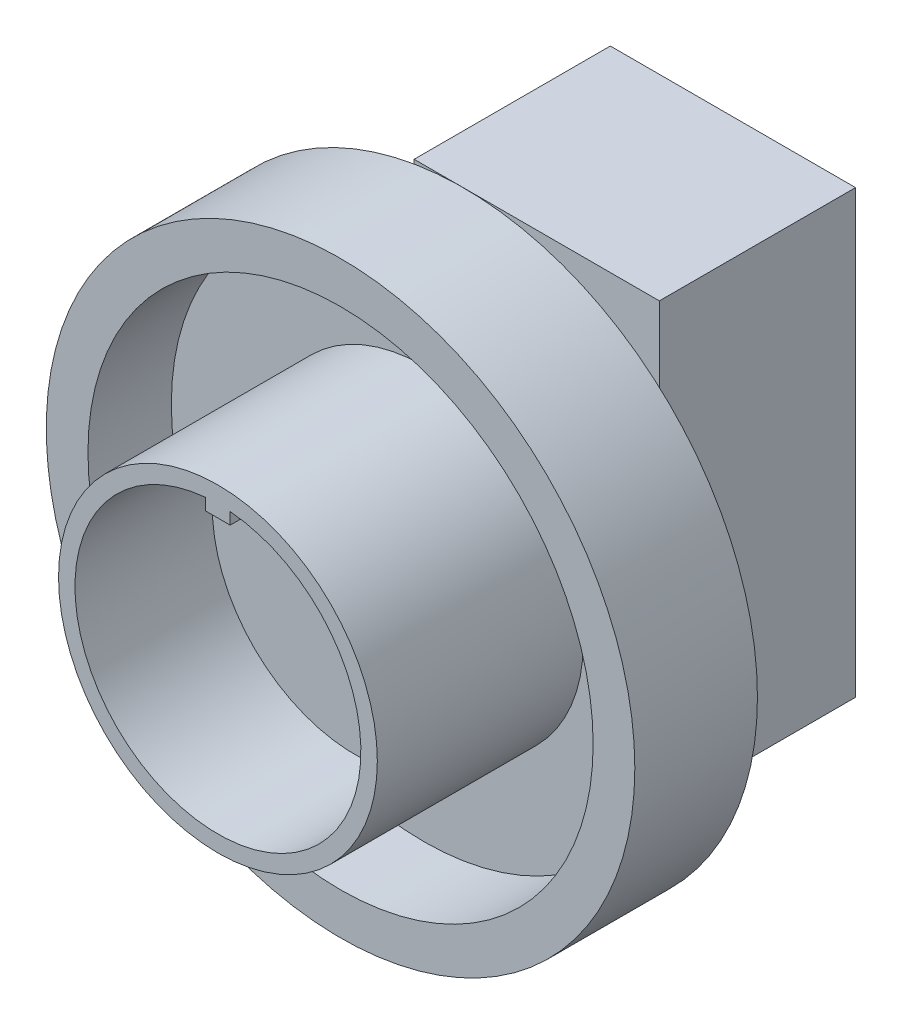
ISO-10303-21;
HEADER;
FILE_DESCRIPTION(('STEP AP214'),'2;1');
FILE_NAME('part.step','',(''),(''),'','','');
FILE_SCHEMA(('AUTOMOTIVE_DESIGN { 1 0 10303 214 1 1 1 1 }'));
ENDSEC;
DATA;
#1=APPLICATION_CONTEXT('core data for automotive mechanical design processes');
#2=APPLICATION_PROTOCOL_DEFINITION('international standard','automotive_design',2000,#1);
#3=PRODUCT_CONTEXT('',#1,'mechanical');
#4=PRODUCT('Part','Part','',(#3));
#5=PRODUCT_RELATED_PRODUCT_CATEGORY('part','',(#4));
#6=PRODUCT_DEFINITION_FORMATION('','',#4);
#7=PRODUCT_DEFINITION_CONTEXT('part definition',#1,'design');
#8=PRODUCT_DEFINITION('design','',#6,#7);
#9=PRODUCT_DEFINITION_SHAPE('','',#8);
#10=(LENGTH_UNIT() NAMED_UNIT(*) SI_UNIT(.MILLI.,.METRE.));
#11=(NAMED_UNIT(*) PLANE_ANGLE_UNIT() SI_UNIT($,.RADIAN.));
#12=(NAMED_UNIT(*) SI_UNIT($,.STERADIAN.) SOLID_ANGLE_UNIT());
#13=UNCERTAINTY_MEASURE_WITH_UNIT(LENGTH_MEASURE(1.E-05),#10,'distance_accuracy_value','');
#14=(GEOMETRIC_REPRESENTATION_CONTEXT(3) GLOBAL_UNCERTAINTY_ASSIGNED_CONTEXT((#13)) GLOBAL_UNIT_ASSIGNED_CONTEXT((#10,
#11,#12)) REPRESENTATION_CONTEXT('',''));
#15=CARTESIAN_POINT('',(0.,0.,0.));
#16=DIRECTION('',(0.,0.,1.));
#17=DIRECTION('',(1.,0.,0.));
#18=AXIS2_PLACEMENT_3D('',#15,#16,#17);
#19=CARTESIAN_POINT('',(0.,0.,0.));
#20=DIRECTION('',(0.,0.,1.));
#21=DIRECTION('',(1.,0.,0.));
#22=AXIS2_PLACEMENT_3D('',#19,#20,#21);
#23=CYLINDRICAL_SURFACE('',#22,25.);
#24=CARTESIAN_POINT('',(0.,0.,-50.));
#25=DIRECTION('',(0.,0.,1.));
#26=DIRECTION('',(1.,0.,0.));
#27=AXIS2_PLACEMENT_3D('',#24,#25,#26);
#28=CIRCLE('',#27,25.);
#29=CARTESIAN_POINT('',(25.,0.,-50.));
#30=VERTEX_POINT('',#29);
#31=EDGE_CURVE('E298',#30,#30,#28,.T.);
#32=ORIENTED_EDGE('',*,*,#31,.F.);
#33=EDGE_LOOP('',(#32));
#34=FACE_BOUND('',#33,.T.);
#35=CARTESIAN_POINT('',(0.,0.,-65.));
#36=DIRECTION('',(0.,0.,1.));
#37=DIRECTION('',(1.,0.,0.));
#38=AXIS2_PLACEMENT_3D('',#35,#36,#37);
#39=CIRCLE('',#38,25.);
#40=CARTESIAN_POINT('',(25.,0.,-65.));
#41=VERTEX_POINT('',#40);
#42=CARTESIAN_POINT('',(-25.,0.,-65.));
#43=VERTEX_POINT('',#42);
#44=EDGE_CURVE('E41',#41,#43,#39,.T.);
#45=ORIENTED_EDGE('',*,*,#44,.T.);
#46=EDGE_CURVE('E300',#43,#41,#39,.T.);
#47=ORIENTED_EDGE('',*,*,#46,.T.);
#48=EDGE_LOOP('',(#45,#47));
#49=FACE_BOUND('',#48,.T.);
#50=ADVANCED_FACE('F34',(#34,#49),#23,.T.);
#51=CARTESIAN_POINT('',(0.,25.,-50.));
#52=DIRECTION('',(0.,0.,1.));
#53=DIRECTION('',(1.,0.,0.));
#54=AXIS2_PLACEMENT_3D('',#51,#52,#53);
#55=PLANE('',#54);
#56=CARTESIAN_POINT('',(0.,0.,-50.));
#57=DIRECTION('',(0.,0.,1.));
#58=DIRECTION('',(1.,0.,0.));
#59=AXIS2_PLACEMENT_3D('',#56,#57,#58);
#60=CIRCLE('',#59,60.);
#61=CARTESIAN_POINT('',(60.,0.,-50.));
#62=VERTEX_POINT('',#61);
#63=EDGE_CURVE('E295',#62,#62,#60,.T.);
#64=ORIENTED_EDGE('',*,*,#63,.F.);
#65=EDGE_LOOP('',(#64));
#66=FACE_BOUND('',#65,.T.);
#67=ORIENTED_EDGE('',*,*,#31,.T.);
#68=EDGE_LOOP('',(#67));
#69=FACE_BOUND('',#68,.T.);
#70=ADVANCED_FACE('F344',(#66,#69),#55,.F.);
#71=CARTESIAN_POINT('',(0.,0.,0.));
#72=DIRECTION('',(0.,0.,1.));
#73=DIRECTION('',(1.,0.,0.));
#74=AXIS2_PLACEMENT_3D('',#71,#72,#73);
#75=CYLINDRICAL_SURFACE('',#74,60.);
#76=CARTESIAN_POINT('',(0.,0.,-25.));
#77=DIRECTION('',(0.,0.,1.));
#78=DIRECTION('',(1.,0.,0.));
#79=AXIS2_PLACEMENT_3D('',#76,#77,#78);
#80=CIRCLE('',#79,60.);
#81=CARTESIAN_POINT('',(60.,0.,-25.));
#82=VERTEX_POINT('',#81);
#83=EDGE_CURVE('E292',#82,#82,#80,.T.);
#84=ORIENTED_EDGE('',*,*,#83,.F.);
#85=EDGE_LOOP('',(#84));
#86=FACE_BOUND('',#85,.T.);
#87=ORIENTED_EDGE('',*,*,#63,.T.);
#88=EDGE_LOOP('',(#87));
#89=FACE_BOUND('',#88,.T.);
#90=ADVANCED_FACE('F349',(#86,#89),#75,.T.);
#91=CARTESIAN_POINT('',(0.,60.,-25.));
#92=DIRECTION('',(0.,0.,-1.));
#93=DIRECTION('',(-1.,0.,0.));
#94=AXIS2_PLACEMENT_3D('',#91,#92,#93);
#95=PLANE('',#94);
#96=CARTESIAN_POINT('',(0.,0.,-25.));
#97=DIRECTION('',(0.,0.,1.));
#98=DIRECTION('',(1.,0.,0.));
#99=AXIS2_PLACEMENT_3D('',#96,#97,#98);
#100=CIRCLE('',#99,51.5);
#101=CARTESIAN_POINT('',(51.5,0.,-25.));
#102=VERTEX_POINT('',#101);
#103=EDGE_CURVE('E289',#102,#102,#100,.T.);
#104=ORIENTED_EDGE('',*,*,#103,.F.);
#105=EDGE_LOOP('',(#104));
#106=FACE_BOUND('',#105,.T.);
#107=ORIENTED_EDGE('',*,*,#83,.T.);
#108=EDGE_LOOP('',(#107));
#109=FACE_BOUND('',#108,.T.);
#110=ADVANCED_FACE('F356',(#106,#109),#95,.F.);
#111=CARTESIAN_POINT('',(0.,0.,0.));
#112=DIRECTION('',(0.,0.,1.));
#113=DIRECTION('',(1.,0.,0.));
#114=AXIS2_PLACEMENT_3D('',#111,#112,#113);
#115=CYLINDRICAL_SURFACE('',#114,51.5);
#116=CARTESIAN_POINT('',(0.,0.,-42.));
#117=DIRECTION('',(0.,0.,1.));
#118=DIRECTION('',(1.,0.,0.));
#119=AXIS2_PLACEMENT_3D('',#116,#117,#118);
#120=CIRCLE('',#119,51.5);
#121=CARTESIAN_POINT('',(51.5,0.,-42.));
#122=VERTEX_POINT('',#121);
#123=EDGE_CURVE('E286',#122,#122,#120,.T.);
#124=ORIENTED_EDGE('',*,*,#123,.F.);
#125=EDGE_LOOP('',(#124));
#126=FACE_BOUND('',#125,.T.);
#127=ORIENTED_EDGE('',*,*,#103,.T.);
#128=EDGE_LOOP('',(#127));
#129=FACE_BOUND('',#128,.T.);
#130=ADVANCED_FACE('F363',(#126,#129),#115,.F.);
#131=CARTESIAN_POINT('',(0.,51.5,-42.));
#132=DIRECTION('',(0.,0.,-1.));
#133=DIRECTION('',(-1.,0.,0.));
#134=AXIS2_PLACEMENT_3D('',#131,#132,#133);
#135=PLANE('',#134);
#136=CARTESIAN_POINT('',(0.,0.,-42.));
#137=DIRECTION('',(0.,0.,1.));
#138=DIRECTION('',(1.,0.,0.));
#139=AXIS2_PLACEMENT_3D('',#136,#137,#138);
#140=CIRCLE('',#139,32.5);
#141=CARTESIAN_POINT('',(32.5,0.,-42.));
#142=VERTEX_POINT('',#141);
#143=EDGE_CURVE('E283',#142,#142,#140,.T.);
#144=ORIENTED_EDGE('',*,*,#143,.F.);
#145=EDGE_LOOP('',(#144));
#146=FACE_BOUND('',#145,.T.);
#147=ORIENTED_EDGE('',*,*,#123,.T.);
#148=EDGE_LOOP('',(#147));
#149=FACE_BOUND('',#148,.T.);
#150=ADVANCED_FACE('F367',(#146,#149),#135,.F.);
#151=CARTESIAN_POINT('',(0.,0.,0.));
#152=DIRECTION('',(0.,0.,1.));
#153=DIRECTION('',(1.,0.,0.));
#154=AXIS2_PLACEMENT_3D('',#151,#152,#153);
#155=CYLINDRICAL_SURFACE('',#154,32.5);
#156=CARTESIAN_POINT('',(0.,0.,0.));
#157=DIRECTION('',(0.,0.,1.));
#158=DIRECTION('',(1.,0.,0.));
#159=AXIS2_PLACEMENT_3D('',#156,#157,#158);
#160=CIRCLE('',#159,32.5);
#161=CARTESIAN_POINT('',(32.5,0.,0.));
#162=VERTEX_POINT('',#161);
#163=EDGE_CURVE('E280',#162,#162,#160,.T.);
#164=ORIENTED_EDGE('',*,*,#163,.F.);
#165=EDGE_LOOP('',(#164));
#166=FACE_BOUND('',#165,.T.);
#167=ORIENTED_EDGE('',*,*,#143,.T.);
#168=EDGE_LOOP('',(#167));
#169=FACE_BOUND('',#168,.T.);
#170=ADVANCED_FACE('F371',(#166,#169),#155,.T.);
#171=CARTESIAN_POINT('',(0.,32.5,0.));
#172=DIRECTION('',(0.,0.,-1.));
#173=DIRECTION('',(-1.,0.,0.));
#174=AXIS2_PLACEMENT_3D('',#171,#172,#173);
#175=PLANE('',#174);
#176=CARTESIAN_POINT('',(0.,0.,0.));
#177=DIRECTION('',(0.,0.,1.));
#178=DIRECTION('',(1.,0.,0.));
#179=AXIS2_PLACEMENT_3D('',#176,#177,#178);
#180=CIRCLE('',#179,29.15);
#181=CARTESIAN_POINT('',(-2.5,29.0425980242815,0.));
#182=VERTEX_POINT('',#181);
#183=CARTESIAN_POINT('',(2.5,29.0425980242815,0.));
#184=VERTEX_POINT('',#183);
#185=EDGE_CURVE('E277',#182,#184,#180,.T.);
#186=ORIENTED_EDGE('',*,*,#185,.F.);
#187=DIRECTION('',(0.,-1.,0.));
#188=VECTOR('',#187,1.);
#189=CARTESIAN_POINT('',(-2.5,31.65,0.));
#190=LINE('',#189,#188);
#191=CARTESIAN_POINT('',(-2.5,26.65,0.));
#192=VERTEX_POINT('',#191);
#193=EDGE_CURVE('E256',#182,#192,#190,.T.);
#194=ORIENTED_EDGE('',*,*,#193,.T.);
#195=DIRECTION('',(1.,0.,0.));
#196=VECTOR('',#195,1.);
#197=CARTESIAN_POINT('',(-2.5,26.65,0.));
#198=LINE('',#197,#196);
#199=CARTESIAN_POINT('',(2.5,26.65,0.));
#200=VERTEX_POINT('',#199);
#201=EDGE_CURVE('E252',#192,#200,#198,.T.);
#202=ORIENTED_EDGE('',*,*,#201,.T.);
#203=DIRECTION('',(0.,1.,0.));
#204=VECTOR('',#203,1.);
#205=CARTESIAN_POINT('',(2.5,31.65,0.));
#206=LINE('',#205,#204);
#207=EDGE_CURVE('E251',#200,#184,#206,.T.);
#208=ORIENTED_EDGE('',*,*,#207,.T.);
#209=EDGE_LOOP('',(#186,#194,#202,#208));
#210=FACE_BOUND('',#209,.T.);
#211=ORIENTED_EDGE('',*,*,#163,.T.);
#212=EDGE_LOOP('',(#211));
#213=FACE_BOUND('',#212,.T.);
#214=ADVANCED_FACE('F375',(#210,#213),#175,.F.);
#215=CARTESIAN_POINT('',(0.,0.,0.));
#216=DIRECTION('',(0.,0.,1.));
#217=DIRECTION('',(1.,0.,0.));
#218=AXIS2_PLACEMENT_3D('',#215,#216,#217);
#219=CYLINDRICAL_SURFACE('',#218,29.15);
#220=CARTESIAN_POINT('',(0.,0.,-28.));
#221=DIRECTION('',(0.,0.,1.));
#222=DIRECTION('',(1.,0.,0.));
#223=AXIS2_PLACEMENT_3D('',#220,#221,#222);
#224=CIRCLE('',#223,29.15);
#225=CARTESIAN_POINT('',(-2.5,29.0425980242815,-28.));
#226=VERTEX_POINT('',#225);
#227=CARTESIAN_POINT('',(2.5,29.0425980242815,-28.));
#228=VERTEX_POINT('',#227);
#229=EDGE_CURVE('E274',#226,#228,#224,.T.);
#230=ORIENTED_EDGE('',*,*,#229,.F.);
#231=DIRECTION('',(0.,0.,1.));
#232=VECTOR('',#231,1.);
#233=CARTESIAN_POINT('',(-2.5,29.0425980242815,0.));
#234=LINE('',#233,#232);
#235=EDGE_CURVE('E271',#226,#182,#234,.T.);
#236=ORIENTED_EDGE('',*,*,#235,.T.);
#237=ORIENTED_EDGE('',*,*,#185,.T.);
#238=DIRECTION('',(0.,0.,1.));
#239=VECTOR('',#238,1.);
#240=CARTESIAN_POINT('',(2.5,29.0425980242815,0.));
#241=LINE('',#240,#239);
#242=EDGE_CURVE('E262',#184,#228,#241,.F.);
#243=ORIENTED_EDGE('',*,*,#242,.T.);
#244=EDGE_LOOP('',(#230,#236,#237,#243));
#245=FACE_BOUND('',#244,.T.);
#246=ADVANCED_FACE('F379',(#245),#219,.F.);
#247=CARTESIAN_POINT('',(0.,29.15,-28.));
#248=DIRECTION('',(0.,0.,-1.));
#249=DIRECTION('',(-1.,0.,0.));
#250=AXIS2_PLACEMENT_3D('',#247,#248,#249);
#251=PLANE('',#250);
#252=DIRECTION('',(1.,0.,0.));
#253=VECTOR('',#252,1.);
#254=CARTESIAN_POINT('',(-2.5,26.65,-28.));
#255=LINE('',#254,#253);
#256=CARTESIAN_POINT('',(-2.5,26.65,-28.));
#257=VERTEX_POINT('',#256);
#258=CARTESIAN_POINT('',(2.5,26.65,-28.));
#259=VERTEX_POINT('',#258);
#260=EDGE_CURVE('E264',#257,#259,#255,.T.);
#261=ORIENTED_EDGE('',*,*,#260,.F.);
#262=DIRECTION('',(0.,1.,0.));
#263=VECTOR('',#262,1.);
#264=CARTESIAN_POINT('',(-2.5,29.15,-28.));
#265=LINE('',#264,#263);
#266=EDGE_CURVE('E12',#257,#226,#265,.T.);
#267=ORIENTED_EDGE('',*,*,#266,.T.);
#268=ORIENTED_EDGE('',*,*,#229,.T.);
#269=DIRECTION('',(0.,1.,0.));
#270=VECTOR('',#269,1.);
#271=CARTESIAN_POINT('',(2.5,31.65,-28.));
#272=LINE('',#271,#270);
#273=EDGE_CURVE('E260',#259,#228,#272,.T.);
#274=ORIENTED_EDGE('',*,*,#273,.F.);
#275=EDGE_LOOP('',(#261,#267,#268,#274));
#276=FACE_BOUND('',#275,.T.);
#277=ADVANCED_FACE('F383',(#276),#251,.F.);
#278=CARTESIAN_POINT('',(-2.5,31.65,-35.0710678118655));
#279=DIRECTION('',(-1.,0.,0.));
#280=DIRECTION('',(0.,-1.,0.));
#281=AXIS2_PLACEMENT_3D('',#278,#279,#280);
#282=PLANE('',#281);
#283=ORIENTED_EDGE('',*,*,#235,.F.);
#284=ORIENTED_EDGE('',*,*,#266,.F.);
#285=DIRECTION('',(0.,0.,1.));
#286=VECTOR('',#285,1.);
#287=CARTESIAN_POINT('',(-2.5,26.65,-35.0710678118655));
#288=LINE('',#287,#286);
#289=EDGE_CURVE('E255',#257,#192,#288,.T.);
#290=ORIENTED_EDGE('',*,*,#289,.T.);
#291=ORIENTED_EDGE('',*,*,#193,.F.);
#292=EDGE_LOOP('',(#283,#284,#290,#291));
#293=FACE_BOUND('',#292,.T.);
#294=ADVANCED_FACE('F387',(#293),#282,.T.);
#295=CARTESIAN_POINT('',(2.5,31.65,-35.0710678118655));
#296=DIRECTION('',(1.,0.,0.));
#297=DIRECTION('',(0.,1.,0.));
#298=AXIS2_PLACEMENT_3D('',#295,#296,#297);
#299=PLANE('',#298);
#300=ORIENTED_EDGE('',*,*,#242,.F.);
#301=ORIENTED_EDGE('',*,*,#207,.F.);
#302=DIRECTION('',(0.,0.,1.));
#303=VECTOR('',#302,1.);
#304=CARTESIAN_POINT('',(2.5,26.65,-35.0710678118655));
#305=LINE('',#304,#303);
#306=EDGE_CURVE('E263',#259,#200,#305,.T.);
#307=ORIENTED_EDGE('',*,*,#306,.F.);
#308=ORIENTED_EDGE('',*,*,#273,.T.);
#309=EDGE_LOOP('',(#300,#301,#307,#308));
#310=FACE_BOUND('',#309,.T.);
#311=ADVANCED_FACE('F391',(#310),#299,.T.);
#312=CARTESIAN_POINT('',(-2.5,26.65,-35.0710678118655));
#313=DIRECTION('',(0.,-1.,0.));
#314=DIRECTION('',(0.,0.,-1.));
#315=AXIS2_PLACEMENT_3D('',#312,#313,#314);
#316=PLANE('',#315);
#317=ORIENTED_EDGE('',*,*,#289,.F.);
#318=ORIENTED_EDGE('',*,*,#260,.T.);
#319=ORIENTED_EDGE('',*,*,#306,.T.);
#320=ORIENTED_EDGE('',*,*,#201,.F.);
#321=EDGE_LOOP('',(#317,#318,#319,#320));
#322=FACE_BOUND('',#321,.T.);
#323=ADVANCED_FACE('F393',(#322),#316,.T.);
#324=CARTESIAN_POINT('',(0.,0.,-65.));
#325=DIRECTION('',(0.,0.,-1.));
#326=DIRECTION('',(-1.,0.,0.));
#327=AXIS2_PLACEMENT_3D('',#324,#325,#326);
#328=PLANE('',#327);
#329=ORIENTED_EDGE('',*,*,#44,.F.);
#330=DIRECTION('',(0.,-1.,0.));
#331=VECTOR('',#330,1.);
#332=CARTESIAN_POINT('',(25.,45.,-65.));
#333=LINE('',#332,#331);
#334=CARTESIAN_POINT('',(25.,45.,-65.));
#335=VERTEX_POINT('',#334);
#336=EDGE_CURVE('E237',#335,#41,#333,.T.);
#337=ORIENTED_EDGE('',*,*,#336,.F.);
#338=DIRECTION('',(1.,0.,0.));
#339=VECTOR('',#338,1.);
#340=CARTESIAN_POINT('',(25.,45.,-65.));
#341=LINE('',#340,#339);
#342=CARTESIAN_POINT('',(-25.,45.,-65.));
#343=VERTEX_POINT('',#342);
#344=EDGE_CURVE('E234',#343,#335,#341,.T.);
#345=ORIENTED_EDGE('',*,*,#344,.F.);
#346=DIRECTION('',(0.,1.,0.));
#347=VECTOR('',#346,1.);
#348=CARTESIAN_POINT('',(-25.,45.,-65.));
#349=LINE('',#348,#347);
#350=EDGE_CURVE('E219',#43,#343,#349,.T.);
#351=ORIENTED_EDGE('',*,*,#350,.F.);
#352=EDGE_LOOP('',(#329,#337,#345,#351));
#353=FACE_BOUND('',#352,.T.);
#354=ADVANCED_FACE('F313',(#353),#328,.F.);
#355=CARTESIAN_POINT('',(-25.,45.,-105.));
#356=DIRECTION('',(1.,0.,0.));
#357=DIRECTION('',(0.,1.,0.));
#358=AXIS2_PLACEMENT_3D('',#355,#356,#357);
#359=PLANE('',#358);
#360=CARTESIAN_POINT('',(-25.,-45.,-65.));
#361=VERTEX_POINT('',#360);
#362=EDGE_CURVE('E231',#361,#43,#349,.T.);
#363=ORIENTED_EDGE('',*,*,#362,.T.);
#364=ORIENTED_EDGE('',*,*,#350,.T.);
#365=DIRECTION('',(0.,0.,1.));
#366=VECTOR('',#365,1.);
#367=CARTESIAN_POINT('',(-25.,45.,-105.));
#368=LINE('',#367,#366);
#369=CARTESIAN_POINT('',(-25.,45.,-105.));
#370=VERTEX_POINT('',#369);
#371=EDGE_CURVE('E248',#370,#343,#368,.T.);
#372=ORIENTED_EDGE('',*,*,#371,.F.);
#373=DIRECTION('',(0.,1.,0.));
#374=VECTOR('',#373,1.);
#375=CARTESIAN_POINT('',(-25.,45.,-105.));
#376=LINE('',#375,#374);
#377=CARTESIAN_POINT('',(-25.,-45.,-105.));
#378=VERTEX_POINT('',#377);
#379=EDGE_CURVE('E220',#378,#370,#376,.T.);
#380=ORIENTED_EDGE('',*,*,#379,.F.);
#381=DIRECTION('',(0.,0.,1.));
#382=VECTOR('',#381,1.);
#383=CARTESIAN_POINT('',(-25.,-45.,-105.));
#384=LINE('',#383,#382);
#385=EDGE_CURVE('E230',#378,#361,#384,.T.);
#386=ORIENTED_EDGE('',*,*,#385,.T.);
#387=EDGE_LOOP('',(#363,#364,#372,#380,#386));
#388=FACE_BOUND('',#387,.T.);
#389=ADVANCED_FACE('F317',(#388),#359,.F.);
#390=CARTESIAN_POINT('',(25.,45.,-105.));
#391=DIRECTION('',(0.,-1.,0.));
#392=DIRECTION('',(0.,0.,-1.));
#393=AXIS2_PLACEMENT_3D('',#390,#391,#392);
#394=PLANE('',#393);
#395=ORIENTED_EDGE('',*,*,#344,.T.);
#396=DIRECTION('',(0.,0.,1.));
#397=VECTOR('',#396,1.);
#398=CARTESIAN_POINT('',(25.,45.,-105.));
#399=LINE('',#398,#397);
#400=CARTESIAN_POINT('',(25.,45.,-105.));
#401=VERTEX_POINT('',#400);
#402=EDGE_CURVE('E245',#401,#335,#399,.T.);
#403=ORIENTED_EDGE('',*,*,#402,.F.);
#404=DIRECTION('',(1.,0.,0.));
#405=VECTOR('',#404,1.);
#406=CARTESIAN_POINT('',(25.,45.,-105.));
#407=LINE('',#406,#405);
#408=EDGE_CURVE('E223',#370,#401,#407,.T.);
#409=ORIENTED_EDGE('',*,*,#408,.F.);
#410=ORIENTED_EDGE('',*,*,#371,.T.);
#411=EDGE_LOOP('',(#395,#403,#409,#410));
#412=FACE_BOUND('',#411,.T.);
#413=ADVANCED_FACE('F329',(#412),#394,.F.);
#414=CARTESIAN_POINT('',(25.,45.,-105.));
#415=DIRECTION('',(-1.,0.,0.));
#416=DIRECTION('',(0.,-1.,0.));
#417=AXIS2_PLACEMENT_3D('',#414,#415,#416);
#418=PLANE('',#417);
#419=ORIENTED_EDGE('',*,*,#336,.T.);
#420=CARTESIAN_POINT('',(25.,-45.,-65.));
#421=VERTEX_POINT('',#420);
#422=EDGE_CURVE('E236',#41,#421,#333,.T.);
#423=ORIENTED_EDGE('',*,*,#422,.T.);
#424=DIRECTION('',(0.,0.,1.));
#425=VECTOR('',#424,1.);
#426=CARTESIAN_POINT('',(25.,-45.,-105.));
#427=LINE('',#426,#425);
#428=CARTESIAN_POINT('',(25.,-45.,-105.));
#429=VERTEX_POINT('',#428);
#430=EDGE_CURVE('E242',#429,#421,#427,.T.);
#431=ORIENTED_EDGE('',*,*,#430,.F.);
#432=DIRECTION('',(0.,-1.,0.));
#433=VECTOR('',#432,1.);
#434=CARTESIAN_POINT('',(25.,45.,-105.));
#435=LINE('',#434,#433);
#436=EDGE_CURVE('E226',#401,#429,#435,.T.);
#437=ORIENTED_EDGE('',*,*,#436,.F.);
#438=ORIENTED_EDGE('',*,*,#402,.T.);
#439=EDGE_LOOP('',(#419,#423,#431,#437,#438));
#440=FACE_BOUND('',#439,.T.);
#441=ADVANCED_FACE('F326',(#440),#418,.F.);
#442=CARTESIAN_POINT('',(25.,-45.,-105.));
#443=DIRECTION('',(0.,1.,0.));
#444=DIRECTION('',(0.,0.,1.));
#445=AXIS2_PLACEMENT_3D('',#442,#443,#444);
#446=PLANE('',#445);
#447=DIRECTION('',(-1.,0.,0.));
#448=VECTOR('',#447,1.);
#449=CARTESIAN_POINT('',(25.,-45.,-65.));
#450=LINE('',#449,#448);
#451=EDGE_CURVE('E224',#421,#361,#450,.T.);
#452=ORIENTED_EDGE('',*,*,#451,.T.);
#453=ORIENTED_EDGE('',*,*,#385,.F.);
#454=DIRECTION('',(-1.,0.,0.));
#455=VECTOR('',#454,1.);
#456=CARTESIAN_POINT('',(25.,-45.,-105.));
#457=LINE('',#456,#455);
#458=EDGE_CURVE('E228',#429,#378,#457,.T.);
#459=ORIENTED_EDGE('',*,*,#458,.F.);
#460=ORIENTED_EDGE('',*,*,#430,.T.);
#461=EDGE_LOOP('',(#452,#453,#459,#460));
#462=FACE_BOUND('',#461,.T.);
#463=ADVANCED_FACE('F322',(#462),#446,.F.);
#464=CARTESIAN_POINT('',(0.,0.,-105.));
#465=DIRECTION('',(0.,0.,-1.));
#466=DIRECTION('',(-1.,0.,0.));
#467=AXIS2_PLACEMENT_3D('',#464,#465,#466);
#468=PLANE('',#467);
#469=DIRECTION('',(0.,1.,0.));
#470=VECTOR('',#469,1.);
#471=CARTESIAN_POINT('',(-20.25,-40.5,-105.));
#472=LINE('',#471,#470);
#473=CARTESIAN_POINT('',(-20.25,-40.5,-105.));
#474=VERTEX_POINT('',#473);
#475=CARTESIAN_POINT('',(-20.25,40.5,-105.));
#476=VERTEX_POINT('',#475);
#477=EDGE_CURVE('E56',#474,#476,#472,.T.);
#478=ORIENTED_EDGE('',*,*,#477,.F.);
#479=DIRECTION('',(-1.,0.,0.));
#480=VECTOR('',#479,1.);
#481=CARTESIAN_POINT('',(20.25,-40.5,-105.));
#482=LINE('',#481,#480);
#483=CARTESIAN_POINT('',(20.25,-40.5,-105.));
#484=VERTEX_POINT('',#483);
#485=EDGE_CURVE('E208',#484,#474,#482,.T.);
#486=ORIENTED_EDGE('',*,*,#485,.F.);
#487=DIRECTION('',(0.,-1.,0.));
#488=VECTOR('',#487,1.);
#489=CARTESIAN_POINT('',(20.25,-40.5,-105.));
#490=LINE('',#489,#488);
#491=CARTESIAN_POINT('',(20.25,40.5,-105.));
#492=VERTEX_POINT('',#491);
#493=EDGE_CURVE('E205',#492,#484,#490,.T.);
#494=ORIENTED_EDGE('',*,*,#493,.F.);
#495=DIRECTION('',(1.,0.,0.));
#496=VECTOR('',#495,1.);
#497=CARTESIAN_POINT('',(20.25,40.5,-105.));
#498=LINE('',#497,#496);
#499=EDGE_CURVE('E202',#476,#492,#498,.T.);
#500=ORIENTED_EDGE('',*,*,#499,.F.);
#501=EDGE_LOOP('',(#478,#486,#494,#500));
#502=FACE_BOUND('',#501,.T.);
#503=ORIENTED_EDGE('',*,*,#379,.T.);
#504=ORIENTED_EDGE('',*,*,#408,.T.);
#505=ORIENTED_EDGE('',*,*,#436,.T.);
#506=ORIENTED_EDGE('',*,*,#458,.T.);
#507=EDGE_LOOP('',(#503,#504,#505,#506));
#508=FACE_BOUND('',#507,.T.);
#509=ADVANCED_FACE('F331',(#502,#508),#468,.T.);
#510=ORIENTED_EDGE('',*,*,#46,.F.);
#511=ORIENTED_EDGE('',*,*,#362,.F.);
#512=ORIENTED_EDGE('',*,*,#451,.F.);
#513=ORIENTED_EDGE('',*,*,#422,.F.);
#514=EDGE_LOOP('',(#510,#511,#512,#513));
#515=FACE_BOUND('',#514,.T.);
#516=ADVANCED_FACE('F309',(#515),#328,.F.);
#517=CARTESIAN_POINT('',(-20.25,-40.5,25.5607530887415));
#518=DIRECTION('',(-1.,0.,0.));
#519=DIRECTION('',(0.,0.,1.));
#520=AXIS2_PLACEMENT_3D('',#517,#518,#519);
#521=PLANE('',#520);
#522=DIRECTION('',(0.,-1.,0.));
#523=VECTOR('',#522,1.);
#524=CARTESIAN_POINT('',(-20.25,-40.5,-73.));
#525=LINE('',#524,#523);
#526=CARTESIAN_POINT('',(-20.25,40.5,-73.));
#527=VERTEX_POINT('',#526);
#528=CARTESIAN_POINT('',(-20.25,-40.5,-73.));
#529=VERTEX_POINT('',#528);
#530=EDGE_CURVE('E198',#527,#529,#525,.T.);
#531=ORIENTED_EDGE('',*,*,#530,.T.);
#532=DIRECTION('',(0.,0.,-1.));
#533=VECTOR('',#532,1.);
#534=CARTESIAN_POINT('',(-20.25,-40.5,25.5607530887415));
#535=LINE('',#534,#533);
#536=EDGE_CURVE('E196',#529,#474,#535,.T.);
#537=ORIENTED_EDGE('',*,*,#536,.T.);
#538=ORIENTED_EDGE('',*,*,#477,.T.);
#539=DIRECTION('',(0.,0.,-1.));
#540=VECTOR('',#539,1.);
#541=CARTESIAN_POINT('',(-20.25,40.5,25.5607530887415));
#542=LINE('',#541,#540);
#543=EDGE_CURVE('E211',#527,#476,#542,.T.);
#544=ORIENTED_EDGE('',*,*,#543,.F.);
#545=EDGE_LOOP('',(#531,#537,#538,#544));
#546=FACE_BOUND('',#545,.T.);
#547=ADVANCED_FACE('F339',(#546),#521,.F.);
#548=CARTESIAN_POINT('',(20.25,-40.5,25.5607530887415));
#549=DIRECTION('',(0.,-1.,0.));
#550=DIRECTION('',(0.,0.,-1.));
#551=AXIS2_PLACEMENT_3D('',#548,#549,#550);
#552=PLANE('',#551);
#553=DIRECTION('',(1.,0.,0.));
#554=VECTOR('',#553,1.);
#555=CARTESIAN_POINT('',(20.25,-40.5,-73.));
#556=LINE('',#555,#554);
#557=CARTESIAN_POINT('',(20.25,-40.5,-73.));
#558=VERTEX_POINT('',#557);
#559=EDGE_CURVE('E195',#529,#558,#556,.T.);
#560=ORIENTED_EDGE('',*,*,#559,.T.);
#561=DIRECTION('',(0.,0.,-1.));
#562=VECTOR('',#561,1.);
#563=CARTESIAN_POINT('',(20.25,-40.5,25.5607530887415));
#564=LINE('',#563,#562);
#565=EDGE_CURVE('E213',#558,#484,#564,.T.);
#566=ORIENTED_EDGE('',*,*,#565,.T.);
#567=ORIENTED_EDGE('',*,*,#485,.T.);
#568=ORIENTED_EDGE('',*,*,#536,.F.);
#569=EDGE_LOOP('',(#560,#566,#567,#568));
#570=FACE_BOUND('',#569,.T.);
#571=ADVANCED_FACE('F432',(#570),#552,.F.);
#572=CARTESIAN_POINT('',(20.25,-40.5,25.5607530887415));
#573=DIRECTION('',(1.,0.,0.));
#574=DIRECTION('',(0.,0.,-1.));
#575=AXIS2_PLACEMENT_3D('',#572,#573,#574);
#576=PLANE('',#575);
#577=DIRECTION('',(0.,1.,0.));
#578=VECTOR('',#577,1.);
#579=CARTESIAN_POINT('',(20.25,-40.5,-73.));
#580=LINE('',#579,#578);
#581=CARTESIAN_POINT('',(20.25,40.5,-73.));
#582=VERTEX_POINT('',#581);
#583=EDGE_CURVE('E193',#558,#582,#580,.T.);
#584=ORIENTED_EDGE('',*,*,#583,.T.);
#585=DIRECTION('',(0.,0.,-1.));
#586=VECTOR('',#585,1.);
#587=CARTESIAN_POINT('',(20.25,40.5,25.5607530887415));
#588=LINE('',#587,#586);
#589=EDGE_CURVE('E215',#582,#492,#588,.T.);
#590=ORIENTED_EDGE('',*,*,#589,.T.);
#591=ORIENTED_EDGE('',*,*,#493,.T.);
#592=ORIENTED_EDGE('',*,*,#565,.F.);
#593=EDGE_LOOP('',(#584,#590,#591,#592));
#594=FACE_BOUND('',#593,.T.);
#595=ADVANCED_FACE('F440',(#594),#576,.F.);
#596=CARTESIAN_POINT('',(20.25,40.5,25.5607530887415));
#597=DIRECTION('',(0.,1.,0.));
#598=DIRECTION('',(0.,0.,1.));
#599=AXIS2_PLACEMENT_3D('',#596,#597,#598);
#600=PLANE('',#599);
#601=DIRECTION('',(-1.,0.,0.));
#602=VECTOR('',#601,1.);
#603=CARTESIAN_POINT('',(20.25,40.5,-73.));
#604=LINE('',#603,#602);
#605=EDGE_CURVE('E200',#582,#527,#604,.T.);
#606=ORIENTED_EDGE('',*,*,#605,.T.);
#607=ORIENTED_EDGE('',*,*,#543,.T.);
#608=ORIENTED_EDGE('',*,*,#499,.T.);
#609=ORIENTED_EDGE('',*,*,#589,.F.);
#610=EDGE_LOOP('',(#606,#607,#608,#609));
#611=FACE_BOUND('',#610,.T.);
#612=ADVANCED_FACE('F450',(#611),#600,.F.);
#613=CARTESIAN_POINT('',(0.,0.,-73.));
#614=DIRECTION('',(0.,0.,-1.));
#615=DIRECTION('',(-1.,0.,0.));
#616=AXIS2_PLACEMENT_3D('',#613,#614,#615);
#617=PLANE('',#616);
#618=DIRECTION('',(0.,-1.,0.));
#619=VECTOR('',#618,1.);
#620=CARTESIAN_POINT('',(11.05,-11.05,-73.));
#621=LINE('',#620,#619);
#622=CARTESIAN_POINT('',(11.05,11.05,-73.));
#623=VERTEX_POINT('',#622);
#624=CARTESIAN_POINT('',(11.05,-11.05,-73.));
#625=VERTEX_POINT('',#624);
#626=EDGE_CURVE('E160',#623,#625,#621,.T.);
#627=ORIENTED_EDGE('',*,*,#626,.F.);
#628=DIRECTION('',(1.,0.,0.));
#629=VECTOR('',#628,1.);
#630=CARTESIAN_POINT('',(-11.05,11.05,-73.));
#631=LINE('',#630,#629);
#632=CARTESIAN_POINT('',(-11.05,11.05,-73.));
#633=VERTEX_POINT('',#632);
#634=EDGE_CURVE('E177',#633,#623,#631,.T.);
#635=ORIENTED_EDGE('',*,*,#634,.F.);
#636=DIRECTION('',(0.,1.,0.));
#637=VECTOR('',#636,1.);
#638=CARTESIAN_POINT('',(-11.05,-11.05,-73.));
#639=LINE('',#638,#637);
#640=CARTESIAN_POINT('',(-11.05,-11.05,-73.));
#641=VERTEX_POINT('',#640);
#642=EDGE_CURVE('E48',#641,#633,#639,.T.);
#643=ORIENTED_EDGE('',*,*,#642,.F.);
#644=DIRECTION('',(-1.,0.,0.));
#645=VECTOR('',#644,1.);
#646=CARTESIAN_POINT('',(-11.05,-11.05,-73.));
#647=LINE('',#646,#645);
#648=EDGE_CURVE('E185',#625,#641,#647,.T.);
#649=ORIENTED_EDGE('',*,*,#648,.F.);
#650=EDGE_LOOP('',(#627,#635,#643,#649));
#651=FACE_BOUND('',#650,.T.);
#652=ORIENTED_EDGE('',*,*,#530,.F.);
#653=ORIENTED_EDGE('',*,*,#605,.F.);
#654=ORIENTED_EDGE('',*,*,#583,.F.);
#655=ORIENTED_EDGE('',*,*,#559,.F.);
#656=EDGE_LOOP('',(#652,#653,#654,#655));
#657=FACE_BOUND('',#656,.T.);
#658=ADVANCED_FACE('F460',(#651,#657),#617,.T.);
#659=CARTESIAN_POINT('',(11.05,-11.05,-56.));
#660=DIRECTION('',(1.,0.,0.));
#661=DIRECTION('',(0.,0.,-1.));
#662=AXIS2_PLACEMENT_3D('',#659,#660,#661);
#663=PLANE('',#662);
#664=ORIENTED_EDGE('',*,*,#626,.T.);
#665=DIRECTION('',(0.,0.,-1.));
#666=VECTOR('',#665,1.);
#667=CARTESIAN_POINT('',(11.05,-11.05,-56.));
#668=LINE('',#667,#666);
#669=CARTESIAN_POINT('',(11.05,-11.05,-56.));
#670=VERTEX_POINT('',#669);
#671=EDGE_CURVE('E153',#670,#625,#668,.T.);
#672=ORIENTED_EDGE('',*,*,#671,.F.);
#673=DIRECTION('',(0.,-1.,0.));
#674=VECTOR('',#673,1.);
#675=CARTESIAN_POINT('',(11.05,-11.05,-56.));
#676=LINE('',#675,#674);
#677=CARTESIAN_POINT('',(11.05,11.05,-56.));
#678=VERTEX_POINT('',#677);
#679=EDGE_CURVE('E157',#678,#670,#676,.T.);
#680=ORIENTED_EDGE('',*,*,#679,.F.);
#681=DIRECTION('',(0.,0.,-1.));
#682=VECTOR('',#681,1.);
#683=CARTESIAN_POINT('',(11.05,11.05,-56.));
#684=LINE('',#683,#682);
#685=EDGE_CURVE('E188',#678,#623,#684,.T.);
#686=ORIENTED_EDGE('',*,*,#685,.T.);
#687=EDGE_LOOP('',(#664,#672,#680,#686));
#688=FACE_BOUND('',#687,.T.);
#689=ADVANCED_FACE('F155',(#688),#663,.F.);
#690=CARTESIAN_POINT('',(-11.05,11.05,-56.));
#691=DIRECTION('',(0.,1.,0.));
#692=DIRECTION('',(-1.,0.,0.));
#693=AXIS2_PLACEMENT_3D('',#690,#691,#692);
#694=PLANE('',#693);
#695=ORIENTED_EDGE('',*,*,#634,.T.);
#696=ORIENTED_EDGE('',*,*,#685,.F.);
#697=DIRECTION('',(1.,0.,0.));
#698=VECTOR('',#697,1.);
#699=CARTESIAN_POINT('',(-11.05,11.05,-56.));
#700=LINE('',#699,#698);
#701=CARTESIAN_POINT('',(-11.05,11.05,-56.));
#702=VERTEX_POINT('',#701);
#703=EDGE_CURVE('E165',#702,#678,#700,.T.);
#704=ORIENTED_EDGE('',*,*,#703,.F.);
#705=DIRECTION('',(0.,0.,-1.));
#706=VECTOR('',#705,1.);
#707=CARTESIAN_POINT('',(-11.05,11.05,-56.));
#708=LINE('',#707,#706);
#709=EDGE_CURVE('E190',#702,#633,#708,.T.);
#710=ORIENTED_EDGE('',*,*,#709,.T.);
#711=EDGE_LOOP('',(#695,#696,#704,#710));
#712=FACE_BOUND('',#711,.T.);
#713=ADVANCED_FACE('F479',(#712),#694,.F.);
#714=CARTESIAN_POINT('',(-11.05,-11.05,-56.));
#715=DIRECTION('',(-1.,0.,0.));
#716=DIRECTION('',(0.,0.,1.));
#717=AXIS2_PLACEMENT_3D('',#714,#715,#716);
#718=PLANE('',#717);
#719=ORIENTED_EDGE('',*,*,#642,.T.);
#720=ORIENTED_EDGE('',*,*,#709,.F.);
#721=DIRECTION('',(0.,1.,0.));
#722=VECTOR('',#721,1.);
#723=CARTESIAN_POINT('',(-11.05,-11.05,-56.));
#724=LINE('',#723,#722);
#725=CARTESIAN_POINT('',(-11.05,-11.05,-56.));
#726=VERTEX_POINT('',#725);
#727=EDGE_CURVE('E173',#726,#702,#724,.T.);
#728=ORIENTED_EDGE('',*,*,#727,.F.);
#729=DIRECTION('',(0.,0.,-1.));
#730=VECTOR('',#729,1.);
#731=CARTESIAN_POINT('',(-11.05,-11.05,-56.));
#732=LINE('',#731,#730);
#733=EDGE_CURVE('E164',#726,#641,#732,.T.);
#734=ORIENTED_EDGE('',*,*,#733,.T.);
#735=EDGE_LOOP('',(#719,#720,#728,#734));
#736=FACE_BOUND('',#735,.T.);
#737=ADVANCED_FACE('F488',(#736),#718,.F.);
#738=CARTESIAN_POINT('',(-11.05,-11.05,-56.));
#739=DIRECTION('',(0.,-1.,0.));
#740=DIRECTION('',(1.,0.,0.));
#741=AXIS2_PLACEMENT_3D('',#738,#739,#740);
#742=PLANE('',#741);
#743=ORIENTED_EDGE('',*,*,#648,.T.);
#744=ORIENTED_EDGE('',*,*,#733,.F.);
#745=DIRECTION('',(-1.,0.,0.));
#746=VECTOR('',#745,1.);
#747=CARTESIAN_POINT('',(-11.05,-11.05,-56.));
#748=LINE('',#747,#746);
#749=EDGE_CURVE('E168',#670,#726,#748,.T.);
#750=ORIENTED_EDGE('',*,*,#749,.F.);
#751=ORIENTED_EDGE('',*,*,#671,.T.);
#752=EDGE_LOOP('',(#743,#744,#750,#751));
#753=FACE_BOUND('',#752,.T.);
#754=ADVANCED_FACE('F169',(#753),#742,.F.);
#755=CARTESIAN_POINT('',(0.,0.,-56.));
#756=DIRECTION('',(0.,0.,-1.));
#757=DIRECTION('',(-1.,0.,0.));
#758=AXIS2_PLACEMENT_3D('',#755,#756,#757);
#759=PLANE('',#758);
#760=ORIENTED_EDGE('',*,*,#679,.T.);
#761=ORIENTED_EDGE('',*,*,#749,.T.);
#762=ORIENTED_EDGE('',*,*,#727,.T.);
#763=ORIENTED_EDGE('',*,*,#703,.T.);
#764=EDGE_LOOP('',(#760,#761,#762,#763));
#765=FACE_BOUND('',#764,.T.);
#766=ADVANCED_FACE('F175',(#765),#759,.T.);
#767=CLOSED_SHELL('',(#50,#70,#90,#110,#130,#150,#170,#214,#246,#277,#294,#311,#323,#354,#389,
#413,#441,#463,#509,#516,#547,#571,#595,#612,#658,#689,#713,#737,#754,#766));
#768=MANIFOLD_SOLID_BREP('B2',#767);
#769=ADVANCED_BREP_SHAPE_REPRESENTATION('',(#18,#768),#14);
#770=SHAPE_DEFINITION_REPRESENTATION(#9,#769);
ENDSEC;
END-ISO-10303-21;
